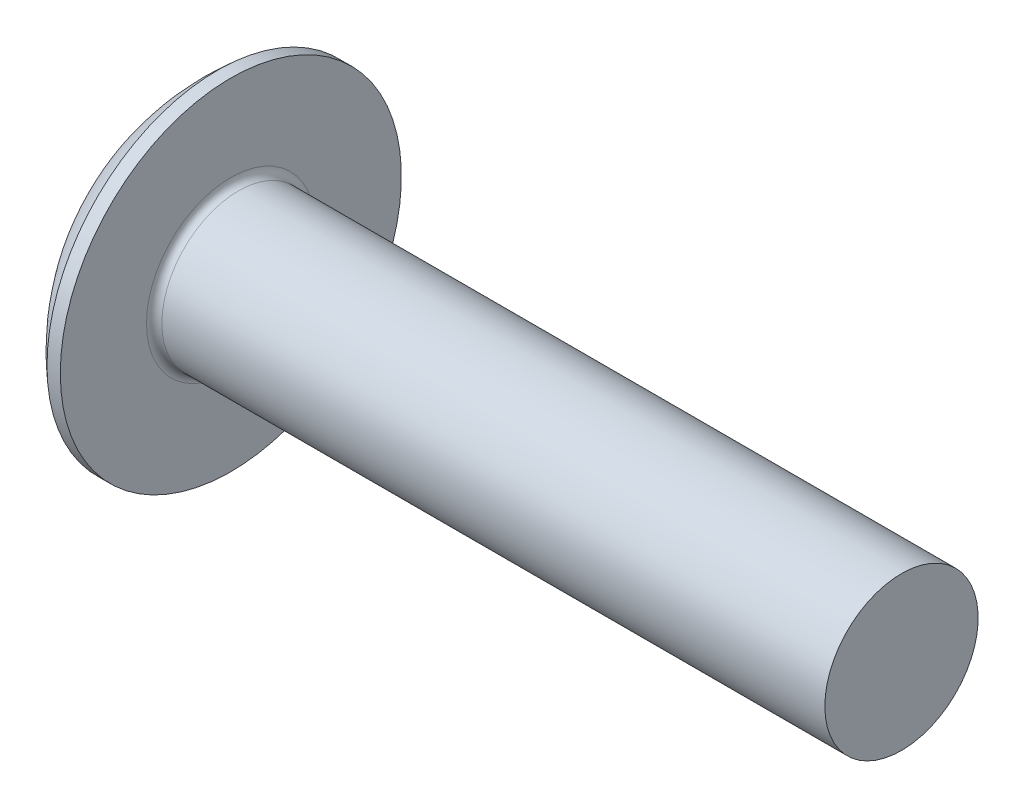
from build123d import *

# Parameters (mm, degrees)
FILLET1_R    = 0.4
RECPAT_COUNT = 2
RECPAT_ANGLE = 90


with BuildPart() as part:
    # BodySke → Base-Revolve (revolve)
    with BuildSketch(Plane.XY, mode=Mode.PRIVATE) as base_revolve_sk:
        with BuildLine():
            Line((4.8, 4), (4.8, 8.9))
            Line((4.8, 8.9), (4.105264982, 8.9))
            ThreePointArc((4.105264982, 8.9), (1.075772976, 4.900591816), (0, 0))
            Line((0, 0), (39.8, 0))
            Line((39.8, 0), (39.8, 4))
            Line((39.8, 4), (4.8, 4))
        make_face()
    revolve(base_revolve_sk.sketch.rotate(Axis((-25.4, 0, 0), (1, 0, 0)), 90), axis=Axis((-25.4, 0, 0), (1, 0, 0)))

    # Fillet1
    fillet1_edges = [part.edges().sort_by_distance(p)[0] for p in [
        (4.8, 0, -4),
    ]]
    fillet(fillet1_edges, radius=FILLET1_R)

    # Sketch3 → Recess section 0
    with BuildSketch(Plane(origin=(0, 0, 0), x_dir=(0, 0, -1), z_dir=(1, 0, 0))):
        with BuildLine():
            Line((0.71, -3.9), (-0.71, -3.9))
            Line((-0.71, -3.9), (-0.71, 3.9))
            Line((-0.71, 3.9), (0.71, 3.9))
            Line((0.71, 3.9), (0.71, -3.9))
        make_face()
    # Sketch4 → Recess section 1
    with BuildSketch(Plane(origin=(4.36, 0, 0), x_dir=(0, 0, -1), z_dir=(1, 0, 0))):
        with BuildLine():
            Line((0.71, -1.726184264), (-0.71, -1.726184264))
            Line((-0.71, -1.726184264), (-0.71, 1.726184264))
            Line((-0.71, 1.726184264), (0.71, 1.726184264))
            Line((0.71, 1.726184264), (0.71, -1.726184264))
        make_face()
    recess = loft(mode=Mode.SUBTRACT)

    # RecPat: Recess ×2 about axis
    recpat_axis = Axis((0, 0, 0), (1, 0, 0))
    for i in range(1, RECPAT_COUNT):
        add(recess.rotate(recpat_axis, i * RECPAT_ANGLE / (RECPAT_COUNT - 1)), mode=Mode.SUBTRACT)

    # RecCorSke → RecessCore (revolve, cut)
    with BuildSketch(Plane.XY, mode=Mode.PRIVATE) as recesscore_sk:
        Polygon((0, 0), (0, 1.5853809), (4.36, 1.2805), (4.776059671, 0), align=None)
    revolve(recesscore_sk.sketch.rotate(Axis((-3.175, 0, 0), (1, 0, 0)), 348.857982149), axis=Axis((-3.175, 0, 0), (1, 0, 0)), mode=Mode.SUBTRACT)


solid = part.part
